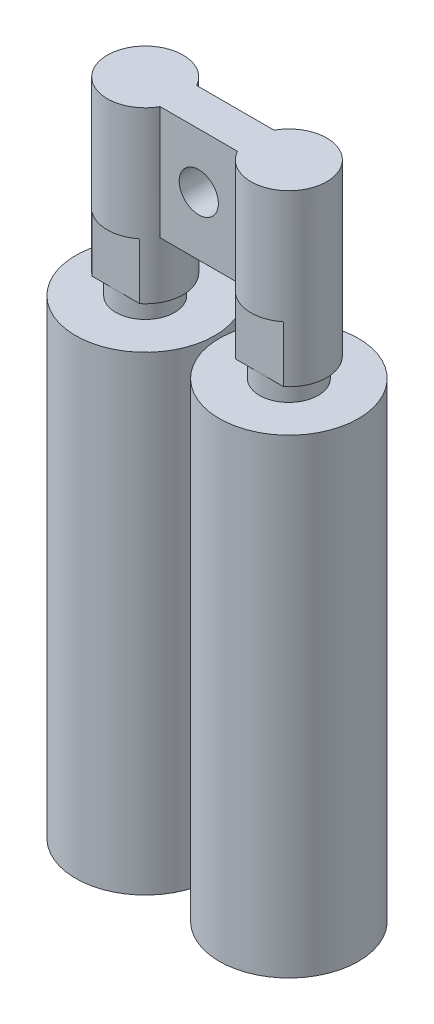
ISO-10303-21;
HEADER;
FILE_DESCRIPTION(('STEP AP214'),'2;1');
FILE_NAME('part.step','',(''),(''),'','','');
FILE_SCHEMA(('AUTOMOTIVE_DESIGN { 1 0 10303 214 1 1 1 1 }'));
ENDSEC;
DATA;
#1=APPLICATION_CONTEXT('core data for automotive mechanical design processes');
#2=APPLICATION_PROTOCOL_DEFINITION('international standard','automotive_design',2000,#1);
#3=PRODUCT_CONTEXT('',#1,'mechanical');
#4=PRODUCT('Part','Part','',(#3));
#5=PRODUCT_RELATED_PRODUCT_CATEGORY('part','',(#4));
#6=PRODUCT_DEFINITION_FORMATION('','',#4);
#7=PRODUCT_DEFINITION_CONTEXT('part definition',#1,'design');
#8=PRODUCT_DEFINITION('design','',#6,#7);
#9=PRODUCT_DEFINITION_SHAPE('','',#8);
#10=(LENGTH_UNIT() NAMED_UNIT(*) SI_UNIT(.MILLI.,.METRE.));
#11=(NAMED_UNIT(*) PLANE_ANGLE_UNIT() SI_UNIT($,.RADIAN.));
#12=(NAMED_UNIT(*) SI_UNIT($,.STERADIAN.) SOLID_ANGLE_UNIT());
#13=UNCERTAINTY_MEASURE_WITH_UNIT(LENGTH_MEASURE(1.E-05),#10,'distance_accuracy_value','');
#14=(GEOMETRIC_REPRESENTATION_CONTEXT(3) GLOBAL_UNCERTAINTY_ASSIGNED_CONTEXT((#13)) GLOBAL_UNIT_ASSIGNED_CONTEXT((#10,
#11,#12)) REPRESENTATION_CONTEXT('',''));
#15=CARTESIAN_POINT('',(0.,0.,0.));
#16=DIRECTION('',(0.,0.,1.));
#17=DIRECTION('',(1.,0.,0.));
#18=AXIS2_PLACEMENT_3D('',#15,#16,#17);
#19=CARTESIAN_POINT('',(-55.,-88.0000000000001,0.));
#20=DIRECTION('',(0.,1.,0.));
#21=DIRECTION('',(-1.,0.,0.));
#22=AXIS2_PLACEMENT_3D('',#19,#20,#21);
#23=CYLINDRICAL_SURFACE('',#22,29.);
#24=DIRECTION('',(0.,1.,0.));
#25=VECTOR('',#24,1.);
#26=CARTESIAN_POINT('',(-29.6031498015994,-88.0000000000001,13.9999999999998));
#27=LINE('',#26,#25);
#28=CARTESIAN_POINT('',(-29.6031498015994,41.9999999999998,13.9999999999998));
#29=VERTEX_POINT('',#28);
#30=CARTESIAN_POINT('',(-29.6031498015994,-44.9999999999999,13.9999999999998));
#31=VERTEX_POINT('',#30);
#32=EDGE_CURVE('E170',#29,#31,#27,.F.);
#33=ORIENTED_EDGE('',*,*,#32,.F.);
#34=CARTESIAN_POINT('',(-55.,41.9999999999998,0.));
#35=DIRECTION('',(0.,1.,0.));
#36=DIRECTION('',(-1.,0.,0.));
#37=AXIS2_PLACEMENT_3D('',#34,#35,#36);
#38=CIRCLE('',#37,29.);
#39=CARTESIAN_POINT('',(-29.6031498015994,41.9999999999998,-14.0000000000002));
#40=VERTEX_POINT('',#39);
#41=EDGE_CURVE('E161',#40,#29,#38,.T.);
#42=ORIENTED_EDGE('',*,*,#41,.F.);
#43=DIRECTION('',(0.,1.,0.));
#44=VECTOR('',#43,1.);
#45=CARTESIAN_POINT('',(-29.6031498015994,-88.0000000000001,-14.0000000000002));
#46=LINE('',#45,#44);
#47=CARTESIAN_POINT('',(-29.6031498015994,-44.9999999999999,-14.0000000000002));
#48=VERTEX_POINT('',#47);
#49=EDGE_CURVE('E182',#40,#48,#46,.F.);
#50=ORIENTED_EDGE('',*,*,#49,.T.);
#51=CARTESIAN_POINT('',(-55.,-44.9999999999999,0.));
#52=DIRECTION('',(0.,-1.,0.));
#53=DIRECTION('',(1.,0.,0.));
#54=AXIS2_PLACEMENT_3D('',#51,#52,#53);
#55=CIRCLE('',#54,29.);
#56=EDGE_CURVE('E167',#48,#31,#55,.T.);
#57=ORIENTED_EDGE('',*,*,#56,.T.);
#58=EDGE_LOOP('',(#33,#42,#50,#57));
#59=FACE_BOUND('',#58,.T.);
#60=CARTESIAN_POINT('',(-55.,-44.9999999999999,0.));
#61=DIRECTION('',(0.,-1.,0.));
#62=DIRECTION('',(1.,0.,0.));
#63=AXIS2_PLACEMENT_3D('',#60,#61,#62);
#64=CIRCLE('',#63,29.);
#65=CARTESIAN_POINT('',(-73.296174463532,-44.9999999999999,22.4999999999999));
#66=VERTEX_POINT('',#65);
#67=CARTESIAN_POINT('',(-36.703825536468,-44.9999999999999,22.5));
#68=VERTEX_POINT('',#67);
#69=EDGE_CURVE('E137',#66,#68,#64,.F.);
#70=ORIENTED_EDGE('',*,*,#69,.T.);
#71=DIRECTION('',(0.,1.,0.));
#72=VECTOR('',#71,1.);
#73=CARTESIAN_POINT('',(-36.703825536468,-88.0000000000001,22.5));
#74=LINE('',#73,#72);
#75=CARTESIAN_POINT('',(-36.703825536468,-88.0000000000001,22.5));
#76=VERTEX_POINT('',#75);
#77=EDGE_CURVE('E297',#68,#76,#74,.F.);
#78=ORIENTED_EDGE('',*,*,#77,.T.);
#79=CARTESIAN_POINT('',(-55.,-88.0000000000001,0.));
#80=DIRECTION('',(0.,1.,0.));
#81=DIRECTION('',(-1.,0.,0.));
#82=AXIS2_PLACEMENT_3D('',#79,#80,#81);
#83=CIRCLE('',#82,29.);
#84=CARTESIAN_POINT('',(-36.703825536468,-88.0000000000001,-22.5));
#85=VERTEX_POINT('',#84);
#86=EDGE_CURVE('E166',#76,#85,#83,.T.);
#87=ORIENTED_EDGE('',*,*,#86,.T.);
#88=DIRECTION('',(0.,1.,0.));
#89=VECTOR('',#88,1.);
#90=CARTESIAN_POINT('',(-36.703825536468,-88.0000000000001,-22.5));
#91=LINE('',#90,#89);
#92=CARTESIAN_POINT('',(-36.703825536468,-44.9999999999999,-22.5));
#93=VERTEX_POINT('',#92);
#94=EDGE_CURVE('E135',#85,#93,#91,.T.);
#95=ORIENTED_EDGE('',*,*,#94,.T.);
#96=CARTESIAN_POINT('',(-73.296174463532,-44.9999999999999,-22.5000000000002));
#97=VERTEX_POINT('',#96);
#98=EDGE_CURVE('E129',#93,#97,#64,.F.);
#99=ORIENTED_EDGE('',*,*,#98,.T.);
#100=DIRECTION('',(0.,1.,0.));
#101=VECTOR('',#100,1.);
#102=CARTESIAN_POINT('',(-73.296174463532,-88.0000000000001,-22.5000000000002));
#103=LINE('',#102,#101);
#104=CARTESIAN_POINT('',(-73.296174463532,-88.0000000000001,-22.5000000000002));
#105=VERTEX_POINT('',#104);
#106=EDGE_CURVE('E115',#97,#105,#103,.F.);
#107=ORIENTED_EDGE('',*,*,#106,.T.);
#108=CARTESIAN_POINT('',(-73.296174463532,-88.0000000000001,22.4999999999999));
#109=VERTEX_POINT('',#108);
#110=EDGE_CURVE('E164',#105,#109,#83,.T.);
#111=ORIENTED_EDGE('',*,*,#110,.T.);
#112=DIRECTION('',(0.,1.,0.));
#113=VECTOR('',#112,1.);
#114=CARTESIAN_POINT('',(-73.296174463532,-88.0000000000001,22.4999999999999));
#115=LINE('',#114,#113);
#116=EDGE_CURVE('E141',#109,#66,#115,.T.);
#117=ORIENTED_EDGE('',*,*,#116,.T.);
#118=EDGE_LOOP('',(#70,#78,#87,#95,#99,#107,#111,#117));
#119=FACE_BOUND('',#118,.T.);
#120=ADVANCED_FACE('F15',(#59,#119),#23,.T.);
#121=CARTESIAN_POINT('',(-55.,-88.0000000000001,0.));
#122=DIRECTION('',(0.,1.,0.));
#123=DIRECTION('',(-1.,0.,0.));
#124=AXIS2_PLACEMENT_3D('',#121,#122,#123);
#125=PLANE('',#124);
#126=DIRECTION('',(1.,0.,0.));
#127=VECTOR('',#126,1.);
#128=CARTESIAN_POINT('',(-55.,-88.0000000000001,22.5));
#129=LINE('',#128,#127);
#130=CARTESIAN_POINT('',(-55.,-88.0000000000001,22.5));
#131=VERTEX_POINT('',#130);
#132=EDGE_CURVE('E38',#109,#131,#129,.T.);
#133=ORIENTED_EDGE('',*,*,#132,.F.);
#134=ORIENTED_EDGE('',*,*,#110,.F.);
#135=DIRECTION('',(-1.,0.,0.));
#136=VECTOR('',#135,1.);
#137=CARTESIAN_POINT('',(-55.,-88.0000000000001,-22.5));
#138=LINE('',#137,#136);
#139=CARTESIAN_POINT('',(-55.,-88.0000000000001,-22.5));
#140=VERTEX_POINT('',#139);
#141=EDGE_CURVE('E120',#140,#105,#138,.T.);
#142=ORIENTED_EDGE('',*,*,#141,.F.);
#143=CARTESIAN_POINT('',(-55.,-88.0000000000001,0.));
#144=DIRECTION('',(0.,1.,0.));
#145=DIRECTION('',(-1.,0.,0.));
#146=AXIS2_PLACEMENT_3D('',#143,#144,#145);
#147=CIRCLE('',#146,22.5);
#148=EDGE_CURVE('E190',#140,#131,#147,.T.);
#149=ORIENTED_EDGE('',*,*,#148,.T.);
#150=EDGE_LOOP('',(#133,#134,#142,#149));
#151=FACE_BOUND('',#150,.T.);
#152=ADVANCED_FACE('F227',(#151),#125,.F.);
#153=EDGE_CURVE('E295',#131,#76,#129,.T.);
#154=ORIENTED_EDGE('',*,*,#153,.F.);
#155=EDGE_CURVE('E152',#131,#140,#147,.T.);
#156=ORIENTED_EDGE('',*,*,#155,.T.);
#157=EDGE_CURVE('E30',#85,#140,#138,.T.);
#158=ORIENTED_EDGE('',*,*,#157,.F.);
#159=ORIENTED_EDGE('',*,*,#86,.F.);
#160=EDGE_LOOP('',(#154,#156,#158,#159));
#161=FACE_BOUND('',#160,.T.);
#162=ADVANCED_FACE('F233',(#161),#125,.F.);
#163=CARTESIAN_POINT('',(55.,-88.0000000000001,-1.66533453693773E-13));
#164=DIRECTION('',(0.,1.,0.));
#165=DIRECTION('',(-1.,0.,0.));
#166=AXIS2_PLACEMENT_3D('',#163,#164,#165);
#167=CYLINDRICAL_SURFACE('',#166,29.);
#168=DIRECTION('',(0.,1.,0.));
#169=VECTOR('',#168,1.);
#170=CARTESIAN_POINT('',(29.6031498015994,-88.0000000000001,14.));
#171=LINE('',#170,#169);
#172=CARTESIAN_POINT('',(29.6031498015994,-44.9999999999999,14.));
#173=VERTEX_POINT('',#172);
#174=CARTESIAN_POINT('',(29.6031498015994,41.9999999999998,14.));
#175=VERTEX_POINT('',#174);
#176=EDGE_CURVE('E159',#173,#175,#171,.T.);
#177=ORIENTED_EDGE('',*,*,#176,.F.);
#178=CARTESIAN_POINT('',(55.,-44.9999999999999,-1.66533453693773E-13));
#179=DIRECTION('',(0.,-1.,0.));
#180=DIRECTION('',(1.,0.,0.));
#181=AXIS2_PLACEMENT_3D('',#178,#179,#180);
#182=CIRCLE('',#181,29.);
#183=CARTESIAN_POINT('',(29.6031498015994,-44.9999999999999,-14.));
#184=VERTEX_POINT('',#183);
#185=EDGE_CURVE('E156',#173,#184,#182,.T.);
#186=ORIENTED_EDGE('',*,*,#185,.T.);
#187=DIRECTION('',(0.,1.,0.));
#188=VECTOR('',#187,1.);
#189=CARTESIAN_POINT('',(29.6031498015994,-88.0000000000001,-14.));
#190=LINE('',#189,#188);
#191=CARTESIAN_POINT('',(29.6031498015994,41.9999999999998,-14.));
#192=VERTEX_POINT('',#191);
#193=EDGE_CURVE('E185',#184,#192,#190,.T.);
#194=ORIENTED_EDGE('',*,*,#193,.T.);
#195=CARTESIAN_POINT('',(55.,41.9999999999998,-1.66533453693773E-13));
#196=DIRECTION('',(0.,1.,0.));
#197=DIRECTION('',(-1.,0.,0.));
#198=AXIS2_PLACEMENT_3D('',#195,#196,#197);
#199=CIRCLE('',#198,29.);
#200=EDGE_CURVE('E148',#175,#192,#199,.T.);
#201=ORIENTED_EDGE('',*,*,#200,.F.);
#202=EDGE_LOOP('',(#177,#186,#194,#201));
#203=FACE_BOUND('',#202,.T.);
#204=CARTESIAN_POINT('',(55.,-44.9999999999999,-1.66533453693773E-13));
#205=DIRECTION('',(0.,-1.,0.));
#206=DIRECTION('',(1.,0.,0.));
#207=AXIS2_PLACEMENT_3D('',#204,#205,#206);
#208=CIRCLE('',#207,29.);
#209=CARTESIAN_POINT('',(36.7038255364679,-44.9999999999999,22.4999999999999));
#210=VERTEX_POINT('',#209);
#211=CARTESIAN_POINT('',(73.296174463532,-44.9999999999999,22.5));
#212=VERTEX_POINT('',#211);
#213=EDGE_CURVE('E10',#210,#212,#208,.F.);
#214=ORIENTED_EDGE('',*,*,#213,.T.);
#215=DIRECTION('',(0.,1.,0.));
#216=VECTOR('',#215,1.);
#217=CARTESIAN_POINT('',(73.296174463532,-88.0000000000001,22.5));
#218=LINE('',#217,#216);
#219=CARTESIAN_POINT('',(73.296174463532,-88.0000000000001,22.5));
#220=VERTEX_POINT('',#219);
#221=EDGE_CURVE('E269',#212,#220,#218,.F.);
#222=ORIENTED_EDGE('',*,*,#221,.T.);
#223=CARTESIAN_POINT('',(55.,-88.0000000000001,-1.66533453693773E-13));
#224=DIRECTION('',(0.,1.,0.));
#225=DIRECTION('',(-1.,0.,0.));
#226=AXIS2_PLACEMENT_3D('',#223,#224,#225);
#227=CIRCLE('',#226,29.);
#228=CARTESIAN_POINT('',(73.296174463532,-88.0000000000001,-22.5));
#229=VERTEX_POINT('',#228);
#230=EDGE_CURVE('E155',#220,#229,#227,.T.);
#231=ORIENTED_EDGE('',*,*,#230,.T.);
#232=DIRECTION('',(0.,1.,0.));
#233=VECTOR('',#232,1.);
#234=CARTESIAN_POINT('',(73.296174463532,-88.0000000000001,-22.5));
#235=LINE('',#234,#233);
#236=CARTESIAN_POINT('',(73.2961744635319,-44.9999999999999,-22.5));
#237=VERTEX_POINT('',#236);
#238=EDGE_CURVE('E288',#229,#237,#235,.T.);
#239=ORIENTED_EDGE('',*,*,#238,.T.);
#240=CARTESIAN_POINT('',(36.7038255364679,-44.9999999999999,-22.5000000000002));
#241=VERTEX_POINT('',#240);
#242=EDGE_CURVE('E19',#237,#241,#208,.F.);
#243=ORIENTED_EDGE('',*,*,#242,.T.);
#244=DIRECTION('',(0.,1.,0.));
#245=VECTOR('',#244,1.);
#246=CARTESIAN_POINT('',(36.703825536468,-88.0000000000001,-22.5000000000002));
#247=LINE('',#246,#245);
#248=CARTESIAN_POINT('',(36.703825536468,-88.0000000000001,-22.5000000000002));
#249=VERTEX_POINT('',#248);
#250=EDGE_CURVE('E280',#241,#249,#247,.F.);
#251=ORIENTED_EDGE('',*,*,#250,.T.);
#252=CARTESIAN_POINT('',(36.703825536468,-88.0000000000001,22.4999999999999));
#253=VERTEX_POINT('',#252);
#254=EDGE_CURVE('E151',#249,#253,#227,.T.);
#255=ORIENTED_EDGE('',*,*,#254,.T.);
#256=DIRECTION('',(0.,1.,0.));
#257=VECTOR('',#256,1.);
#258=CARTESIAN_POINT('',(36.703825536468,-88.0000000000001,22.4999999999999));
#259=LINE('',#258,#257);
#260=EDGE_CURVE('E271',#253,#210,#259,.T.);
#261=ORIENTED_EDGE('',*,*,#260,.T.);
#262=EDGE_LOOP('',(#214,#222,#231,#239,#243,#251,#255,#261));
#263=FACE_BOUND('',#262,.T.);
#264=ADVANCED_FACE('F258',(#203,#263),#167,.T.);
#265=CARTESIAN_POINT('',(55.,-88.0000000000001,-1.66533453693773E-13));
#266=DIRECTION('',(0.,1.,0.));
#267=DIRECTION('',(-1.,0.,0.));
#268=AXIS2_PLACEMENT_3D('',#265,#266,#267);
#269=PLANE('',#268);
#270=DIRECTION('',(1.,0.,0.));
#271=VECTOR('',#270,1.);
#272=CARTESIAN_POINT('',(55.,-88.0000000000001,22.4999999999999));
#273=LINE('',#272,#271);
#274=CARTESIAN_POINT('',(55.,-88.0000000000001,22.4999999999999));
#275=VERTEX_POINT('',#274);
#276=EDGE_CURVE('E205',#253,#275,#273,.T.);
#277=ORIENTED_EDGE('',*,*,#276,.F.);
#278=ORIENTED_EDGE('',*,*,#254,.F.);
#279=DIRECTION('',(-1.,0.,0.));
#280=VECTOR('',#279,1.);
#281=CARTESIAN_POINT('',(55.,-88.0000000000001,-22.5000000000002));
#282=LINE('',#281,#280);
#283=CARTESIAN_POINT('',(55.,-88.0000000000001,-22.5000000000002));
#284=VERTEX_POINT('',#283);
#285=EDGE_CURVE('E206',#284,#249,#282,.T.);
#286=ORIENTED_EDGE('',*,*,#285,.F.);
#287=CARTESIAN_POINT('',(55.,-88.0000000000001,-1.66533453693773E-13));
#288=DIRECTION('',(0.,1.,0.));
#289=DIRECTION('',(-1.,0.,0.));
#290=AXIS2_PLACEMENT_3D('',#287,#288,#289);
#291=CIRCLE('',#290,22.5);
#292=EDGE_CURVE('E147',#284,#275,#291,.T.);
#293=ORIENTED_EDGE('',*,*,#292,.T.);
#294=EDGE_LOOP('',(#277,#278,#286,#293));
#295=FACE_BOUND('',#294,.T.);
#296=ADVANCED_FACE('F203',(#295),#269,.F.);
#297=EDGE_CURVE('E292',#275,#220,#273,.T.);
#298=ORIENTED_EDGE('',*,*,#297,.F.);
#299=EDGE_CURVE('E191',#275,#284,#291,.T.);
#300=ORIENTED_EDGE('',*,*,#299,.T.);
#301=EDGE_CURVE('E125',#229,#284,#282,.T.);
#302=ORIENTED_EDGE('',*,*,#301,.F.);
#303=ORIENTED_EDGE('',*,*,#230,.F.);
#304=EDGE_LOOP('',(#298,#300,#302,#303));
#305=FACE_BOUND('',#304,.T.);
#306=ADVANCED_FACE('F251',(#305),#269,.F.);
#307=CARTESIAN_POINT('',(55.,-44.9999999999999,13.9999999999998));
#308=DIRECTION('',(0.,-1.,0.));
#309=DIRECTION('',(1.,0.,0.));
#310=AXIS2_PLACEMENT_3D('',#307,#308,#309);
#311=PLANE('',#310);
#312=ORIENTED_EDGE('',*,*,#185,.F.);
#313=DIRECTION('',(-1.,0.,0.));
#314=VECTOR('',#313,1.);
#315=CARTESIAN_POINT('',(55.,-44.9999999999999,13.9999999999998));
#316=LINE('',#315,#314);
#317=EDGE_CURVE('E177',#173,#31,#316,.T.);
#318=ORIENTED_EDGE('',*,*,#317,.T.);
#319=ORIENTED_EDGE('',*,*,#56,.F.);
#320=DIRECTION('',(-1.,0.,0.));
#321=VECTOR('',#320,1.);
#322=CARTESIAN_POINT('',(55.,-44.9999999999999,-14.0000000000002));
#323=LINE('',#322,#321);
#324=EDGE_CURVE('E173',#184,#48,#323,.T.);
#325=ORIENTED_EDGE('',*,*,#324,.F.);
#326=EDGE_LOOP('',(#312,#318,#319,#325));
#327=FACE_BOUND('',#326,.T.);
#328=ADVANCED_FACE('F17',(#327),#311,.T.);
#329=CARTESIAN_POINT('',(-55.,41.9999999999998,14.));
#330=DIRECTION('',(0.,1.,0.));
#331=DIRECTION('',(-1.,0.,0.));
#332=AXIS2_PLACEMENT_3D('',#329,#330,#331);
#333=PLANE('',#332);
#334=DIRECTION('',(1.,0.,0.));
#335=VECTOR('',#334,1.);
#336=CARTESIAN_POINT('',(-55.,41.9999999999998,14.));
#337=LINE('',#336,#335);
#338=EDGE_CURVE('E179',#29,#175,#337,.T.);
#339=ORIENTED_EDGE('',*,*,#338,.T.);
#340=ORIENTED_EDGE('',*,*,#200,.T.);
#341=DIRECTION('',(1.,0.,0.));
#342=VECTOR('',#341,1.);
#343=CARTESIAN_POINT('',(-55.,41.9999999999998,-14.));
#344=LINE('',#343,#342);
#345=EDGE_CURVE('E175',#40,#192,#344,.T.);
#346=ORIENTED_EDGE('',*,*,#345,.F.);
#347=ORIENTED_EDGE('',*,*,#41,.T.);
#348=EDGE_LOOP('',(#339,#340,#346,#347));
#349=FACE_BOUND('',#348,.T.);
#350=ADVANCED_FACE('F244',(#349),#333,.T.);
#351=CARTESIAN_POINT('',(-55.,-44.9999999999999,14.));
#352=DIRECTION('',(0.,0.,-1.));
#353=DIRECTION('',(-1.,0.,0.));
#354=AXIS2_PLACEMENT_3D('',#351,#352,#353);
#355=PLANE('',#354);
#356=CARTESIAN_POINT('',(0.,0.,14.));
#357=DIRECTION('',(0.,0.,-1.));
#358=DIRECTION('',(-1.,0.,0.));
#359=AXIS2_PLACEMENT_3D('',#356,#357,#358);
#360=CIRCLE('',#359,15.);
#361=CARTESIAN_POINT('',(-15.,0.,14.));
#362=VERTEX_POINT('',#361);
#363=EDGE_CURVE('E140',#362,#362,#360,.T.);
#364=ORIENTED_EDGE('',*,*,#363,.T.);
#365=EDGE_LOOP('',(#364));
#366=FACE_BOUND('',#365,.T.);
#367=ORIENTED_EDGE('',*,*,#317,.F.);
#368=ORIENTED_EDGE('',*,*,#176,.T.);
#369=ORIENTED_EDGE('',*,*,#338,.F.);
#370=ORIENTED_EDGE('',*,*,#32,.T.);
#371=EDGE_LOOP('',(#367,#368,#369,#370));
#372=FACE_BOUND('',#371,.T.);
#373=ADVANCED_FACE('F241',(#366,#372),#355,.F.);
#374=CARTESIAN_POINT('',(-55.,-44.9999999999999,-14.));
#375=DIRECTION('',(0.,0.,-1.));
#376=DIRECTION('',(-1.,0.,0.));
#377=AXIS2_PLACEMENT_3D('',#374,#375,#376);
#378=PLANE('',#377);
#379=CARTESIAN_POINT('',(0.,0.,-14.));
#380=DIRECTION('',(0.,0.,-1.));
#381=DIRECTION('',(-1.,0.,0.));
#382=AXIS2_PLACEMENT_3D('',#379,#380,#381);
#383=CIRCLE('',#382,15.);
#384=CARTESIAN_POINT('',(-15.,0.,-14.));
#385=VERTEX_POINT('',#384);
#386=EDGE_CURVE('E136',#385,#385,#383,.T.);
#387=ORIENTED_EDGE('',*,*,#386,.F.);
#388=EDGE_LOOP('',(#387));
#389=FACE_BOUND('',#388,.T.);
#390=ORIENTED_EDGE('',*,*,#193,.F.);
#391=ORIENTED_EDGE('',*,*,#324,.T.);
#392=ORIENTED_EDGE('',*,*,#49,.F.);
#393=ORIENTED_EDGE('',*,*,#345,.T.);
#394=EDGE_LOOP('',(#390,#391,#392,#393));
#395=FACE_BOUND('',#394,.T.);
#396=ADVANCED_FACE('F222',(#389,#395),#378,.T.);
#397=CARTESIAN_POINT('',(-55.,-103.,0.));
#398=DIRECTION('',(0.,1.,0.));
#399=DIRECTION('',(-1.,0.,0.));
#400=AXIS2_PLACEMENT_3D('',#397,#398,#399);
#401=CYLINDRICAL_SURFACE('',#400,22.5);
#402=CARTESIAN_POINT('',(-55.,-103.,0.));
#403=DIRECTION('',(0.,-1.,0.));
#404=DIRECTION('',(1.,0.,0.));
#405=AXIS2_PLACEMENT_3D('',#402,#403,#404);
#406=CIRCLE('',#405,22.5);
#407=CARTESIAN_POINT('',(-32.5,-103.,0.));
#408=VERTEX_POINT('',#407);
#409=EDGE_CURVE('E304',#408,#408,#406,.F.);
#410=ORIENTED_EDGE('',*,*,#409,.T.);
#411=EDGE_LOOP('',(#410));
#412=FACE_BOUND('',#411,.T.);
#413=ORIENTED_EDGE('',*,*,#155,.F.);
#414=ORIENTED_EDGE('',*,*,#148,.F.);
#415=EDGE_LOOP('',(#413,#414));
#416=FACE_BOUND('',#415,.T.);
#417=ADVANCED_FACE('F211',(#412,#416),#401,.T.);
#418=CARTESIAN_POINT('',(55.,-103.,-1.66533453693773E-13));
#419=DIRECTION('',(0.,1.,0.));
#420=DIRECTION('',(-1.,0.,0.));
#421=AXIS2_PLACEMENT_3D('',#418,#419,#420);
#422=CYLINDRICAL_SURFACE('',#421,22.5);
#423=CARTESIAN_POINT('',(55.,-103.,-1.66533453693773E-13));
#424=DIRECTION('',(0.,-1.,0.));
#425=DIRECTION('',(1.,0.,0.));
#426=AXIS2_PLACEMENT_3D('',#423,#424,#425);
#427=CIRCLE('',#426,22.5);
#428=CARTESIAN_POINT('',(77.5,-103.,-1.66533453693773E-13));
#429=VERTEX_POINT('',#428);
#430=EDGE_CURVE('E314',#429,#429,#427,.F.);
#431=ORIENTED_EDGE('',*,*,#430,.T.);
#432=EDGE_LOOP('',(#431));
#433=FACE_BOUND('',#432,.T.);
#434=ORIENTED_EDGE('',*,*,#299,.F.);
#435=ORIENTED_EDGE('',*,*,#292,.F.);
#436=EDGE_LOOP('',(#434,#435));
#437=FACE_BOUND('',#436,.T.);
#438=ADVANCED_FACE('F208',(#433,#437),#422,.T.);
#439=CARTESIAN_POINT('',(0.,0.,-29.));
#440=DIRECTION('',(0.,0.,1.));
#441=DIRECTION('',(1.,0.,0.));
#442=AXIS2_PLACEMENT_3D('',#439,#440,#441);
#443=CYLINDRICAL_SURFACE('',#442,15.);
#444=ORIENTED_EDGE('',*,*,#386,.T.);
#445=EDGE_LOOP('',(#444));
#446=FACE_BOUND('',#445,.T.);
#447=ORIENTED_EDGE('',*,*,#363,.F.);
#448=EDGE_LOOP('',(#447));
#449=FACE_BOUND('',#448,.T.);
#450=ADVANCED_FACE('F210',(#446,#449),#443,.F.);
#451=CARTESIAN_POINT('',(-90.,-44.9999999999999,-22.5000000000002));
#452=DIRECTION('',(0.,0.,-1.));
#453=DIRECTION('',(-1.,0.,0.));
#454=AXIS2_PLACEMENT_3D('',#451,#452,#453);
#455=PLANE('',#454);
#456=ORIENTED_EDGE('',*,*,#301,.T.);
#457=ORIENTED_EDGE('',*,*,#285,.T.);
#458=ORIENTED_EDGE('',*,*,#250,.F.);
#459=DIRECTION('',(1.,0.,0.));
#460=VECTOR('',#459,1.);
#461=CARTESIAN_POINT('',(-90.,-44.9999999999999,-22.5000000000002));
#462=LINE('',#461,#460);
#463=EDGE_CURVE('E131',#241,#237,#462,.T.);
#464=ORIENTED_EDGE('',*,*,#463,.T.);
#465=ORIENTED_EDGE('',*,*,#238,.F.);
#466=EDGE_LOOP('',(#456,#457,#458,#464,#465));
#467=FACE_BOUND('',#466,.T.);
#468=ADVANCED_FACE('F219',(#467),#455,.T.);
#469=CARTESIAN_POINT('',(0.699999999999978,-44.9999999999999,0.));
#470=DIRECTION('',(0.,-1.,0.));
#471=DIRECTION('',(1.,0.,0.));
#472=AXIS2_PLACEMENT_3D('',#469,#470,#471);
#473=PLANE('',#472);
#474=ORIENTED_EDGE('',*,*,#463,.F.);
#475=ORIENTED_EDGE('',*,*,#242,.F.);
#476=EDGE_LOOP('',(#474,#475));
#477=FACE_BOUND('',#476,.T.);
#478=ADVANCED_FACE('F358',(#477),#473,.T.);
#479=CARTESIAN_POINT('',(-90.,-44.9999999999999,22.4999999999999));
#480=DIRECTION('',(0.,0.,1.));
#481=DIRECTION('',(1.,0.,0.));
#482=AXIS2_PLACEMENT_3D('',#479,#480,#481);
#483=PLANE('',#482);
#484=ORIENTED_EDGE('',*,*,#276,.T.);
#485=ORIENTED_EDGE('',*,*,#297,.T.);
#486=ORIENTED_EDGE('',*,*,#221,.F.);
#487=DIRECTION('',(-1.,0.,0.));
#488=VECTOR('',#487,1.);
#489=CARTESIAN_POINT('',(-90.,-44.9999999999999,22.4999999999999));
#490=LINE('',#489,#488);
#491=EDGE_CURVE('E276',#212,#210,#490,.T.);
#492=ORIENTED_EDGE('',*,*,#491,.T.);
#493=ORIENTED_EDGE('',*,*,#260,.F.);
#494=EDGE_LOOP('',(#484,#485,#486,#492,#493));
#495=FACE_BOUND('',#494,.T.);
#496=ADVANCED_FACE('F278',(#495),#483,.T.);
#497=ORIENTED_EDGE('',*,*,#491,.F.);
#498=ORIENTED_EDGE('',*,*,#213,.F.);
#499=EDGE_LOOP('',(#497,#498));
#500=FACE_BOUND('',#499,.T.);
#501=ADVANCED_FACE('F275',(#500),#473,.T.);
#502=ORIENTED_EDGE('',*,*,#157,.T.);
#503=ORIENTED_EDGE('',*,*,#141,.T.);
#504=ORIENTED_EDGE('',*,*,#106,.F.);
#505=EDGE_CURVE('E118',#97,#93,#462,.T.);
#506=ORIENTED_EDGE('',*,*,#505,.T.);
#507=ORIENTED_EDGE('',*,*,#94,.F.);
#508=EDGE_LOOP('',(#502,#503,#504,#506,#507));
#509=FACE_BOUND('',#508,.T.);
#510=ADVANCED_FACE('F117',(#509),#455,.T.);
#511=ORIENTED_EDGE('',*,*,#505,.F.);
#512=ORIENTED_EDGE('',*,*,#98,.F.);
#513=EDGE_LOOP('',(#511,#512));
#514=FACE_BOUND('',#513,.T.);
#515=ADVANCED_FACE('F128',(#514),#473,.T.);
#516=EDGE_CURVE('E130',#68,#66,#490,.T.);
#517=ORIENTED_EDGE('',*,*,#516,.F.);
#518=ORIENTED_EDGE('',*,*,#69,.F.);
#519=EDGE_LOOP('',(#517,#518));
#520=FACE_BOUND('',#519,.T.);
#521=ADVANCED_FACE('F355',(#520),#473,.T.);
#522=ORIENTED_EDGE('',*,*,#132,.T.);
#523=ORIENTED_EDGE('',*,*,#153,.T.);
#524=ORIENTED_EDGE('',*,*,#77,.F.);
#525=ORIENTED_EDGE('',*,*,#516,.T.);
#526=ORIENTED_EDGE('',*,*,#116,.F.);
#527=EDGE_LOOP('',(#522,#523,#524,#525,#526));
#528=FACE_BOUND('',#527,.T.);
#529=ADVANCED_FACE('F351',(#528),#483,.T.);
#530=CARTESIAN_POINT('',(-55.,-463.,0.));
#531=DIRECTION('',(0.,1.,0.));
#532=DIRECTION('',(-1.,0.,0.));
#533=AXIS2_PLACEMENT_3D('',#530,#531,#532);
#534=CYLINDRICAL_SURFACE('',#533,53.25);
#535=CARTESIAN_POINT('',(-55.,-463.,0.));
#536=DIRECTION('',(0.,-1.,0.));
#537=DIRECTION('',(1.,0.,0.));
#538=AXIS2_PLACEMENT_3D('',#535,#536,#537);
#539=CIRCLE('',#538,53.25);
#540=CARTESIAN_POINT('',(-1.74999999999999,-463.,0.));
#541=VERTEX_POINT('',#540);
#542=EDGE_CURVE('E306',#541,#541,#539,.T.);
#543=ORIENTED_EDGE('',*,*,#542,.F.);
#544=EDGE_LOOP('',(#543));
#545=FACE_BOUND('',#544,.T.);
#546=CARTESIAN_POINT('',(-55.,-103.,0.));
#547=DIRECTION('',(0.,-1.,0.));
#548=DIRECTION('',(1.,0.,0.));
#549=AXIS2_PLACEMENT_3D('',#546,#547,#548);
#550=CIRCLE('',#549,53.25);
#551=CARTESIAN_POINT('',(-1.74999999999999,-103.,0.));
#552=VERTEX_POINT('',#551);
#553=EDGE_CURVE('E309',#552,#552,#550,.T.);
#554=ORIENTED_EDGE('',*,*,#553,.T.);
#555=EDGE_LOOP('',(#554));
#556=FACE_BOUND('',#555,.T.);
#557=ADVANCED_FACE('F347',(#545,#556),#534,.T.);
#558=CARTESIAN_POINT('',(-55.,-463.,0.));
#559=DIRECTION('',(0.,-1.,0.));
#560=DIRECTION('',(1.,0.,0.));
#561=AXIS2_PLACEMENT_3D('',#558,#559,#560);
#562=PLANE('',#561);
#563=ORIENTED_EDGE('',*,*,#542,.T.);
#564=EDGE_LOOP('',(#563));
#565=FACE_BOUND('',#564,.T.);
#566=ADVANCED_FACE('F343',(#565),#562,.T.);
#567=CARTESIAN_POINT('',(-55.,-103.,0.));
#568=DIRECTION('',(0.,-1.,0.));
#569=DIRECTION('',(1.,0.,0.));
#570=AXIS2_PLACEMENT_3D('',#567,#568,#569);
#571=PLANE('',#570);
#572=ORIENTED_EDGE('',*,*,#409,.F.);
#573=EDGE_LOOP('',(#572));
#574=FACE_BOUND('',#573,.T.);
#575=ORIENTED_EDGE('',*,*,#553,.F.);
#576=EDGE_LOOP('',(#575));
#577=FACE_BOUND('',#576,.T.);
#578=ADVANCED_FACE('F339',(#574,#577),#571,.F.);
#579=CARTESIAN_POINT('',(55.,-463.,-1.66533453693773E-13));
#580=DIRECTION('',(0.,1.,0.));
#581=DIRECTION('',(-1.,0.,0.));
#582=AXIS2_PLACEMENT_3D('',#579,#580,#581);
#583=CYLINDRICAL_SURFACE('',#582,53.25);
#584=CARTESIAN_POINT('',(55.,-463.,-1.66533453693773E-13));
#585=DIRECTION('',(0.,-1.,0.));
#586=DIRECTION('',(1.,0.,0.));
#587=AXIS2_PLACEMENT_3D('',#584,#585,#586);
#588=CIRCLE('',#587,53.25);
#589=CARTESIAN_POINT('',(108.25,-463.,-1.66533453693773E-13));
#590=VERTEX_POINT('',#589);
#591=EDGE_CURVE('E316',#590,#590,#588,.T.);
#592=ORIENTED_EDGE('',*,*,#591,.F.);
#593=EDGE_LOOP('',(#592));
#594=FACE_BOUND('',#593,.T.);
#595=CARTESIAN_POINT('',(55.,-103.,-1.66533453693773E-13));
#596=DIRECTION('',(0.,-1.,0.));
#597=DIRECTION('',(1.,0.,0.));
#598=AXIS2_PLACEMENT_3D('',#595,#596,#597);
#599=CIRCLE('',#598,53.25);
#600=CARTESIAN_POINT('',(108.25,-103.,-1.66533453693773E-13));
#601=VERTEX_POINT('',#600);
#602=EDGE_CURVE('E319',#601,#601,#599,.T.);
#603=ORIENTED_EDGE('',*,*,#602,.T.);
#604=EDGE_LOOP('',(#603));
#605=FACE_BOUND('',#604,.T.);
#606=ADVANCED_FACE('F323',(#594,#605),#583,.T.);
#607=CARTESIAN_POINT('',(55.,-463.,-1.66533453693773E-13));
#608=DIRECTION('',(0.,-1.,0.));
#609=DIRECTION('',(1.,0.,0.));
#610=AXIS2_PLACEMENT_3D('',#607,#608,#609);
#611=PLANE('',#610);
#612=ORIENTED_EDGE('',*,*,#591,.T.);
#613=EDGE_LOOP('',(#612));
#614=FACE_BOUND('',#613,.T.);
#615=ADVANCED_FACE('F327',(#614),#611,.T.);
#616=CARTESIAN_POINT('',(55.,-103.,-1.66533453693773E-13));
#617=DIRECTION('',(0.,-1.,0.));
#618=DIRECTION('',(1.,0.,0.));
#619=AXIS2_PLACEMENT_3D('',#616,#617,#618);
#620=PLANE('',#619);
#621=ORIENTED_EDGE('',*,*,#430,.F.);
#622=EDGE_LOOP('',(#621));
#623=FACE_BOUND('',#622,.T.);
#624=ORIENTED_EDGE('',*,*,#602,.F.);
#625=EDGE_LOOP('',(#624));
#626=FACE_BOUND('',#625,.T.);
#627=ADVANCED_FACE('F325',(#623,#626),#620,.F.);
#628=CLOSED_SHELL('',(#120,#152,#162,#264,#296,#306,#328,#350,#373,#396,#417,#438,#450,#468,
#478,#496,#501,#510,#515,#521,#529,#557,#566,#578,#606,#615,#627));
#629=MANIFOLD_SOLID_BREP('B1',#628);
#630=ADVANCED_BREP_SHAPE_REPRESENTATION('',(#18,#629),#14);
#631=SHAPE_DEFINITION_REPRESENTATION(#9,#630);
ENDSEC;
END-ISO-10303-21;
